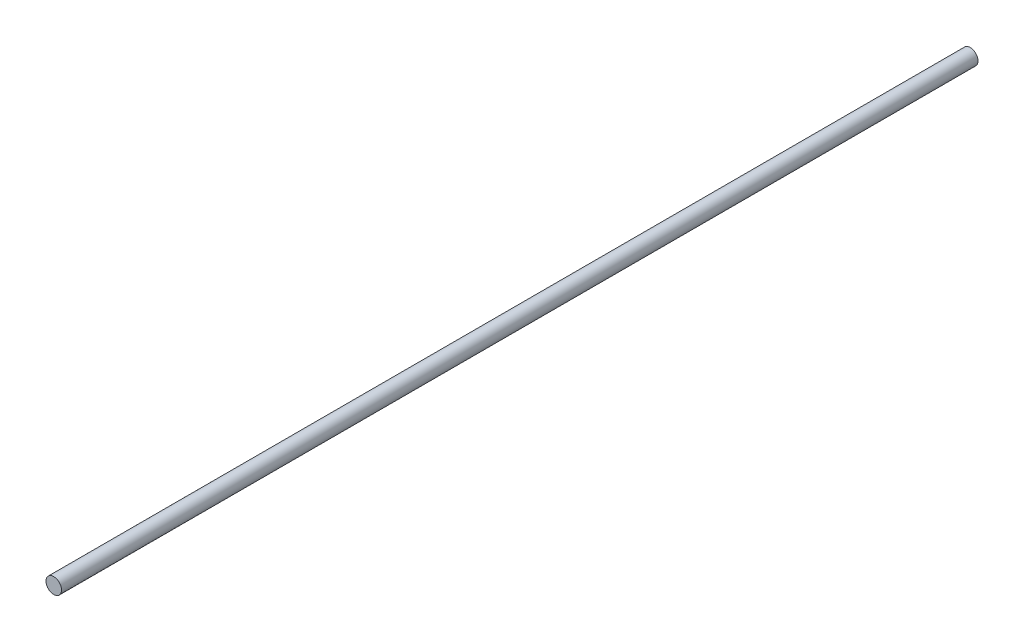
from build123d import *

# Parameters (mm, degrees)
ESQUISSE1_R      = 0.5
EXTRUSION1_DEPTH = 59


with BuildPart() as part:
    # Esquisse1 → Extrusion1 (new body)
    with BuildSketch(Plane.XY):
        Circle(ESQUISSE1_R)
    extrude(amount=EXTRUSION1_DEPTH)


solid = part.part
